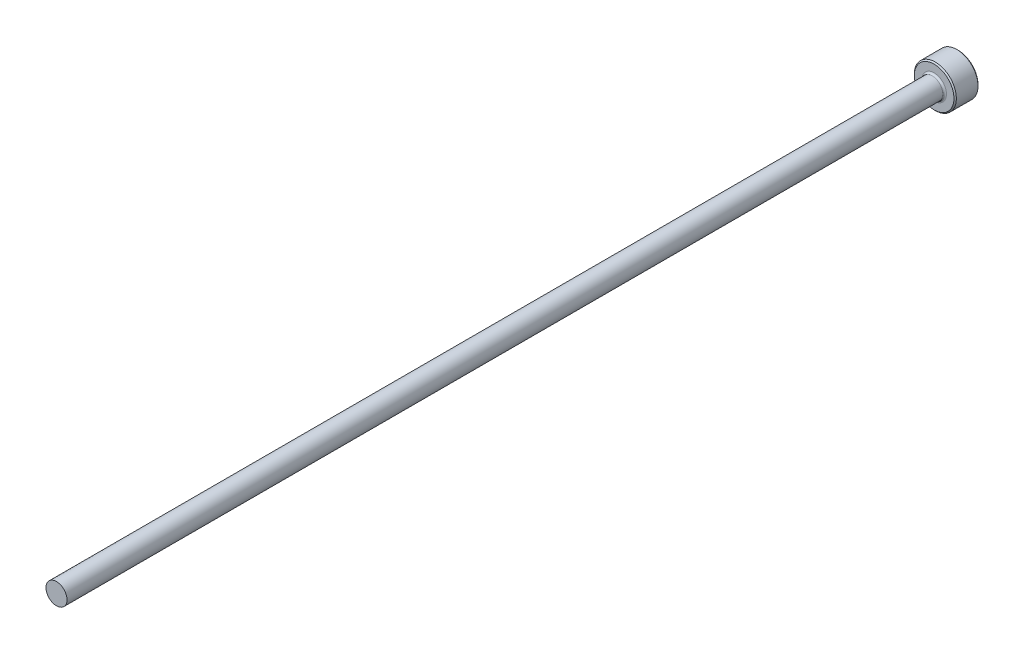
ISO-10303-21;
HEADER;
FILE_DESCRIPTION(('STEP AP214'),'2;1');
FILE_NAME('part.step','',(''),(''),'','','');
FILE_SCHEMA(('AUTOMOTIVE_DESIGN { 1 0 10303 214 1 1 1 1 }'));
ENDSEC;
DATA;
#1=APPLICATION_CONTEXT('core data for automotive mechanical design processes');
#2=APPLICATION_PROTOCOL_DEFINITION('international standard','automotive_design',2000,#1);
#3=PRODUCT_CONTEXT('',#1,'mechanical');
#4=PRODUCT('Part','Part','',(#3));
#5=PRODUCT_RELATED_PRODUCT_CATEGORY('part','',(#4));
#6=PRODUCT_DEFINITION_FORMATION('','',#4);
#7=PRODUCT_DEFINITION_CONTEXT('part definition',#1,'design');
#8=PRODUCT_DEFINITION('design','',#6,#7);
#9=PRODUCT_DEFINITION_SHAPE('','',#8);
#10=(LENGTH_UNIT() NAMED_UNIT(*) SI_UNIT(.MILLI.,.METRE.));
#11=(NAMED_UNIT(*) PLANE_ANGLE_UNIT() SI_UNIT($,.RADIAN.));
#12=(NAMED_UNIT(*) SI_UNIT($,.STERADIAN.) SOLID_ANGLE_UNIT());
#13=UNCERTAINTY_MEASURE_WITH_UNIT(LENGTH_MEASURE(1.E-05),#10,'distance_accuracy_value','');
#14=(GEOMETRIC_REPRESENTATION_CONTEXT(3) GLOBAL_UNCERTAINTY_ASSIGNED_CONTEXT((#13)) GLOBAL_UNIT_ASSIGNED_CONTEXT((#10,
#11,#12)) REPRESENTATION_CONTEXT('',''));
#15=CARTESIAN_POINT('',(0.,0.,0.));
#16=DIRECTION('',(0.,0.,1.));
#17=DIRECTION('',(1.,0.,0.));
#18=AXIS2_PLACEMENT_3D('',#15,#16,#17);
#19=CARTESIAN_POINT('',(0.,1.74999999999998,150.));
#20=DIRECTION('',(0.,0.,-1.));
#21=DIRECTION('',(-1.,0.,0.));
#22=AXIS2_PLACEMENT_3D('',#19,#20,#21);
#23=PLANE('',#22);
#24=CARTESIAN_POINT('',(0.,0.,150.));
#25=DIRECTION('',(0.,0.,1.));
#26=DIRECTION('',(1.,0.,0.));
#27=AXIS2_PLACEMENT_3D('',#24,#25,#26);
#28=CIRCLE('',#27,1.74999999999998);
#29=CARTESIAN_POINT('',(1.74999999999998,0.,150.));
#30=VERTEX_POINT('',#29);
#31=EDGE_CURVE('E50',#30,#30,#28,.T.);
#32=ORIENTED_EDGE('',*,*,#31,.T.);
#33=EDGE_LOOP('',(#32));
#34=FACE_BOUND('',#33,.T.);
#35=ADVANCED_FACE('F30',(#34),#23,.F.);
#36=CARTESIAN_POINT('',(0.,0.,109.050628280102));
#37=DIRECTION('',(0.,0.,1.));
#38=DIRECTION('',(1.,0.,0.));
#39=AXIS2_PLACEMENT_3D('',#36,#37,#38);
#40=CYLINDRICAL_SURFACE('',#39,1.74999999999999);
#41=ORIENTED_EDGE('',*,*,#31,.F.);
#42=EDGE_LOOP('',(#41));
#43=FACE_BOUND('',#42,.T.);
#44=CARTESIAN_POINT('',(0.,0.,4.3));
#45=DIRECTION('',(0.,0.,1.));
#46=DIRECTION('',(1.,0.,0.));
#47=AXIS2_PLACEMENT_3D('',#44,#45,#46);
#48=CIRCLE('',#47,1.75);
#49=CARTESIAN_POINT('',(1.75,0.,4.3));
#50=VERTEX_POINT('',#49);
#51=EDGE_CURVE('E53',#50,#50,#48,.T.);
#52=ORIENTED_EDGE('',*,*,#51,.T.);
#53=EDGE_LOOP('',(#52));
#54=FACE_BOUND('',#53,.T.);
#55=ADVANCED_FACE('F73',(#43,#54),#40,.T.);
#56=CARTESIAN_POINT('',(0.,0.,4.3));
#57=DIRECTION('',(0.,0.,1.));
#58=DIRECTION('',(1.,0.,0.));
#59=AXIS2_PLACEMENT_3D('',#56,#57,#58);
#60=TOROIDAL_SURFACE('',#59,2.05,0.3);
#61=ORIENTED_EDGE('',*,*,#51,.F.);
#62=EDGE_LOOP('',(#61));
#63=FACE_BOUND('',#62,.T.);
#64=CARTESIAN_POINT('',(0.,0.,4.));
#65=DIRECTION('',(0.,0.,1.));
#66=DIRECTION('',(1.,0.,0.));
#67=AXIS2_PLACEMENT_3D('',#64,#65,#66);
#68=CIRCLE('',#67,2.05);
#69=CARTESIAN_POINT('',(2.05,0.,4.));
#70=VERTEX_POINT('',#69);
#71=EDGE_CURVE('E56',#70,#70,#68,.T.);
#72=ORIENTED_EDGE('',*,*,#71,.T.);
#73=EDGE_LOOP('',(#72));
#74=FACE_BOUND('',#73,.T.);
#75=ADVANCED_FACE('F60',(#63,#74),#60,.F.);
#76=CARTESIAN_POINT('',(0.,3.5,4.));
#77=DIRECTION('',(0.,0.,-1.));
#78=DIRECTION('',(-1.,0.,0.));
#79=AXIS2_PLACEMENT_3D('',#76,#77,#78);
#80=PLANE('',#79);
#81=CARTESIAN_POINT('',(0.,0.,4.));
#82=DIRECTION('',(0.,0.,-1.));
#83=DIRECTION('',(-1.,0.,0.));
#84=AXIS2_PLACEMENT_3D('',#81,#82,#83);
#85=CIRCLE('',#84,3.30000000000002);
#86=CARTESIAN_POINT('',(-3.30000000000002,0.,4.));
#87=VERTEX_POINT('',#86);
#88=EDGE_CURVE('E10',#87,#87,#85,.F.);
#89=ORIENTED_EDGE('',*,*,#88,.T.);
#90=EDGE_LOOP('',(#89));
#91=FACE_BOUND('',#90,.T.);
#92=ORIENTED_EDGE('',*,*,#71,.F.);
#93=EDGE_LOOP('',(#92));
#94=FACE_BOUND('',#93,.T.);
#95=ADVANCED_FACE('F62',(#91,#94),#80,.F.);
#96=CARTESIAN_POINT('',(0.,0.,109.050628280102));
#97=DIRECTION('',(0.,0.,1.));
#98=DIRECTION('',(1.,0.,0.));
#99=AXIS2_PLACEMENT_3D('',#96,#97,#98);
#100=CYLINDRICAL_SURFACE('',#99,3.5);
#101=CARTESIAN_POINT('',(0.,0.,0.200000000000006));
#102=DIRECTION('',(0.,0.,1.));
#103=DIRECTION('',(1.,0.,0.));
#104=AXIS2_PLACEMENT_3D('',#101,#102,#103);
#105=CIRCLE('',#104,3.5);
#106=CARTESIAN_POINT('',(3.5,0.,0.200000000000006));
#107=VERTEX_POINT('',#106);
#108=EDGE_CURVE('E41',#107,#107,#105,.T.);
#109=ORIENTED_EDGE('',*,*,#108,.T.);
#110=EDGE_LOOP('',(#109));
#111=FACE_BOUND('',#110,.T.);
#112=CARTESIAN_POINT('',(0.,0.,3.80000000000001));
#113=DIRECTION('',(0.,0.,-1.));
#114=DIRECTION('',(-1.,0.,0.));
#115=AXIS2_PLACEMENT_3D('',#112,#113,#114);
#116=CIRCLE('',#115,3.5);
#117=CARTESIAN_POINT('',(-3.5,0.,3.80000000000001));
#118=VERTEX_POINT('',#117);
#119=EDGE_CURVE('E45',#118,#118,#116,.T.);
#120=ORIENTED_EDGE('',*,*,#119,.T.);
#121=EDGE_LOOP('',(#120));
#122=FACE_BOUND('',#121,.T.);
#123=ADVANCED_FACE('F64',(#111,#122),#100,.T.);
#124=CARTESIAN_POINT('',(0.,0.,0.));
#125=DIRECTION('',(0.,0.,1.));
#126=DIRECTION('',(1.,0.,0.));
#127=AXIS2_PLACEMENT_3D('',#124,#125,#126);
#128=PLANE('',#127);
#129=CARTESIAN_POINT('',(0.,0.,0.));
#130=DIRECTION('',(0.,0.,1.));
#131=DIRECTION('',(1.,0.,0.));
#132=AXIS2_PLACEMENT_3D('',#129,#130,#131);
#133=CIRCLE('',#132,3.3);
#134=CARTESIAN_POINT('',(3.3,0.,0.));
#135=VERTEX_POINT('',#134);
#136=EDGE_CURVE('E37',#135,#135,#133,.F.);
#137=ORIENTED_EDGE('',*,*,#136,.T.);
#138=EDGE_LOOP('',(#137));
#139=FACE_BOUND('',#138,.T.);
#140=ADVANCED_FACE('F70',(#139),#128,.F.);
#141=CARTESIAN_POINT('',(0.,0.,0.200000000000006));
#142=DIRECTION('',(0.,0.,1.));
#143=DIRECTION('',(1.,0.,0.));
#144=AXIS2_PLACEMENT_3D('',#141,#142,#143);
#145=CONICAL_SURFACE('',#144,3.5,0.785398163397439);
#146=ORIENTED_EDGE('',*,*,#136,.F.);
#147=EDGE_LOOP('',(#146));
#148=FACE_BOUND('',#147,.T.);
#149=ORIENTED_EDGE('',*,*,#108,.F.);
#150=EDGE_LOOP('',(#149));
#151=FACE_BOUND('',#150,.T.);
#152=ADVANCED_FACE('F84',(#148,#151),#145,.T.);
#153=CARTESIAN_POINT('',(0.,0.,4.));
#154=DIRECTION('',(0.,0.,-1.));
#155=DIRECTION('',(-1.,0.,0.));
#156=AXIS2_PLACEMENT_3D('',#153,#154,#155);
#157=CONICAL_SURFACE('',#156,3.30000000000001,0.785398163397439);
#158=ORIENTED_EDGE('',*,*,#119,.F.);
#159=EDGE_LOOP('',(#158));
#160=FACE_BOUND('',#159,.T.);
#161=ORIENTED_EDGE('',*,*,#88,.F.);
#162=EDGE_LOOP('',(#161));
#163=FACE_BOUND('',#162,.T.);
#164=ADVANCED_FACE('F32',(#160,#163),#157,.T.);
#165=CLOSED_SHELL('',(#35,#55,#75,#95,#123,#140,#152,#164));
#166=MANIFOLD_SOLID_BREP('B2',#165);
#167=ADVANCED_BREP_SHAPE_REPRESENTATION('',(#18,#166),#14);
#168=SHAPE_DEFINITION_REPRESENTATION(#9,#167);
ENDSEC;
END-ISO-10303-21;
